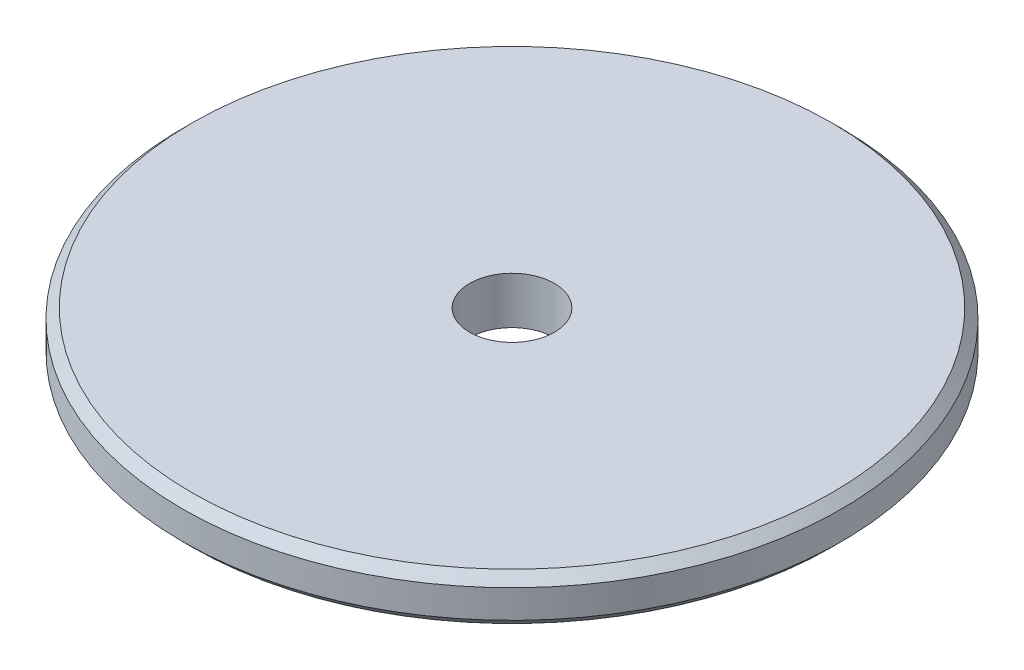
from build123d import *

# Parameters (mm, degrees)
SKETCH1_R      = 35
SKETCH1_R_2    = 4.5
EXTRUDE1_DEPTH = 5
CHAMFER1_SIZE  = 1


with BuildPart() as part:
    # Sketch1 → Extrude1 (new body)
    with BuildSketch(Plane(origin=(0, 0, 0), x_dir=(1, 0, 0), z_dir=(0, 1, 0))):
        with Locations(Location((0, 0, 0), (0, 0, 270))):
            Circle(SKETCH1_R)
        with Locations(Location((0, 0, 0), (0, 0, 270))):
            Circle(SKETCH1_R_2, mode=Mode.SUBTRACT)
    extrude(amount=EXTRUDE1_DEPTH)

    # Chamfer1
    chamfer1_edges = [part.edges().sort_by_distance(p)[0] for p in [
        (0, 0, -35),
        (0, 5, -35),
    ]]
    chamfer(chamfer1_edges, length=CHAMFER1_SIZE)


solid = part.part
